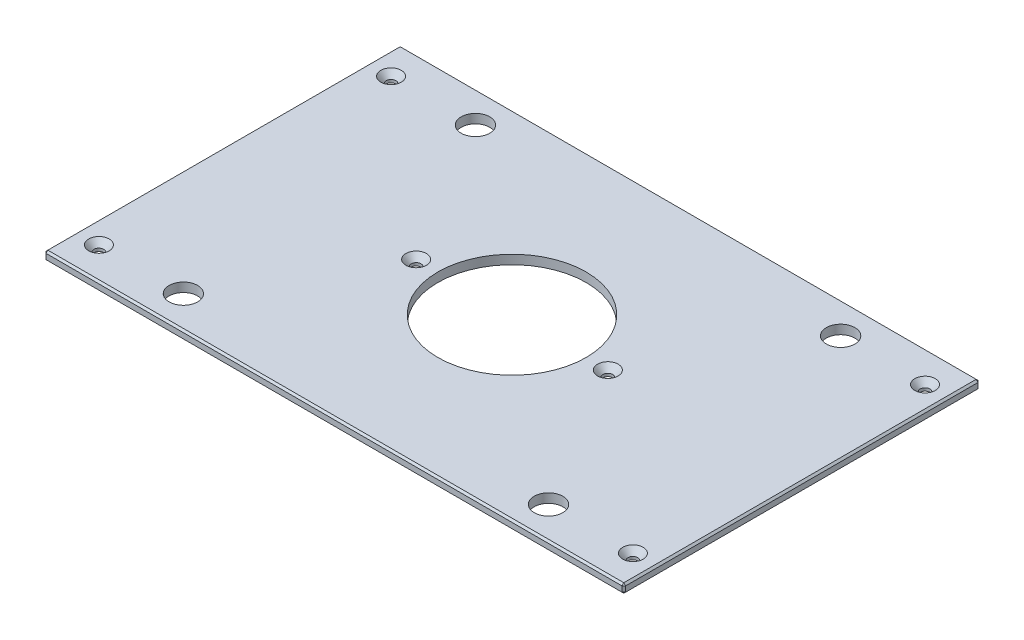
from build123d import *

# Parameters (mm, degrees)
SKETCH1_W                                     = 403.225
SKETCH1_H                                     = 247.65
BOSS_EXTRUDE1_DEPTH                           = 6.35
SKETCH13_R                                    = 51.562
CUT_EXTRUDE6_DEPTH                            = 237.686614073
F_25_32_0_78125_DIAMETER_HOLE1_D              = 19.84375
CHAMFER2_SIZE                                 = 1.27
CSK_FOR_1_4_FLAT_HEAD_MACHINE_SCREW1_AT_COUNT = 2
CSK_FOR_1_4_FLAT_HEAD_MACHINE_SCREW1_AT_PITCH = 203.2
CSK_FOR_1_4_FLAT_HEAD_MACHINE_SCREW1_2_COUNT  = 2
CSK_FOR_1_4_FLAT_HEAD_MACHINE_SCREW1_2_PITCH  = 423.419314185
CSK_FOR_1_4_FLAT_HEAD_MACHINE_SCREW1_3_COUNT  = 2
CSK_FOR_1_4_FLAT_HEAD_MACHINE_SCREW1_3_PITCH  = 272.093054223
CSK_FOR_1_4_FLAT_HEAD_MACHINE_SCREW1_4_COUNT  = 2
CSK_FOR_1_4_FLAT_HEAD_MACHINE_SCREW1_4_PITCH  = 156.519771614
CSK_FOR_1_4_FLAT_HEAD_MACHINE_SCREW1_5_COUNT  = 2
CSK_FOR_1_4_FLAT_HEAD_MACHINE_SCREW1_5_PITCH  = 371.475
CSK_FOR_1_4_FLAT_HEAD_MACHINE_SCREW1_6_COUNT  = 2
CSK_FOR_1_4_FLAT_HEAD_MACHINE_SCREW1_6_PITCH  = 312.7375
CSK_FOR_1_4_FLAT_HEAD_MACHINE_SCREW1_7_COUNT  = 2
CSK_FOR_1_4_FLAT_HEAD_MACHINE_SCREW1_7_PITCH  = 372.954399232


with BuildPart() as part:
    # Sketch1 → Boss-Extrude1 (new body)
    with BuildSketch(Plane(origin=(0, 0, 0), x_dir=(1, 0, 0), z_dir=(0, 1, 0))):
        Rectangle(SKETCH1_W, SKETCH1_H)
    extrude(amount=BOSS_EXTRUDE1_DEPTH)

    # Sketch13 → Cut-Extrude6 (cut, through all)
    with BuildSketch(Plane(origin=(0, 6.35, 0), x_dir=(1, 0, 0), z_dir=(0, 1, 0))):
        with Locations(Location((0, 0, 0), (0, 0, 270))):
            Circle(SKETCH13_R)
    extrude(amount=-CUT_EXTRUDE6_DEPTH, mode=Mode.SUBTRACT)

    # 25_32 _0.78125_ Diameter Hole1 (through all)
    with Locations(Plane(origin=(0, 6.35, 0), x_dir=(1, 0, 0), z_dir=(0, 1, 0))):
        with Locations((127, 101.6), (-127, 101.6), (127, -101.6), (-127, -101.6)):
            Hole(F_25_32_0_78125_DIAMETER_HOLE1_D / 2)

    # Chamfer2
    chamfer2_edges = [part.edges().sort_by_distance(p)[0] for p in [
        (201.6125, 6.35, 0),
        (0, 6.35, -123.825),
        (-201.6125, 6.35, 0),
        (0, 0, -123.825),
        (201.6125, 0, 0),
        (0, 0, 123.825),
        (-201.6125, 0, 0),
        (0, 6.35, 123.825),
        (-201.6125, 3.175, -123.825),
        (201.6125, 3.175, -123.825),
        (201.6125, 3.175, 123.825),
        (-201.6125, 3.175, 123.825),
    ]]
    chamfer(chamfer2_edges, length=CHAMFER2_SIZE)

    # Sketch24 → CSK for 1_4 Flat Head Machine Screw1 (revolve, cut)
    with BuildSketch(Plane(origin=(185.7375, 6.35, -101.6), x_dir=(0, 0, 1), z_dir=(1, 0, 0))):
        Polygon((0, 0), (0, 6.35), (3.3782, 6.35), (3.3782, 4.324464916), (7.1374, 0), align=None)
    csk_for_1_4_flat_head_machine_screw1 = revolve(axis=Axis((185.7375, 12.7, -101.6), (0, -1, 0)), mode=Mode.SUBTRACT)

    # CSK for 1_4 Flat Head Machine Screw1 at: CSK for 1_4 Flat Head Machine Screw1 ×2
    with Locations(*[(0, 0, i * CSK_FOR_1_4_FLAT_HEAD_MACHINE_SCREW1_AT_PITCH) for i in range(1, CSK_FOR_1_4_FLAT_HEAD_MACHINE_SCREW1_AT_COUNT)]):
        add(csk_for_1_4_flat_head_machine_screw1, mode=Mode.SUBTRACT)

    # CSK for 1_4 Flat Head Machine Screw1 2: CSK for 1_4 Flat Head Machine Screw1 ×2
    with Locations(*[Vector(-0.8773218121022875, 0, 0.4799025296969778) * (i * CSK_FOR_1_4_FLAT_HEAD_MACHINE_SCREW1_2_PITCH) for i in range(1, CSK_FOR_1_4_FLAT_HEAD_MACHINE_SCREW1_2_COUNT)]):
        add(csk_for_1_4_flat_head_machine_screw1, mode=Mode.SUBTRACT)

    # CSK for 1_4 Flat Head Machine Screw1 3: CSK for 1_4 Flat Head Machine Screw1 ×2
    with Locations(*[Vector(-0.9276697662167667, 0, 0.37340166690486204) * (i * CSK_FOR_1_4_FLAT_HEAD_MACHINE_SCREW1_3_PITCH) for i in range(1, CSK_FOR_1_4_FLAT_HEAD_MACHINE_SCREW1_3_COUNT)]):
        add(csk_for_1_4_flat_head_machine_screw1, mode=Mode.SUBTRACT)

    # CSK for 1_4 Flat Head Machine Screw1 4: CSK for 1_4 Flat Head Machine Screw1 ×2
    with Locations(*[Vector(-0.7606866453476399, 0, 0.6491192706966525) * (i * CSK_FOR_1_4_FLAT_HEAD_MACHINE_SCREW1_4_PITCH) for i in range(1, CSK_FOR_1_4_FLAT_HEAD_MACHINE_SCREW1_4_COUNT)]):
        add(csk_for_1_4_flat_head_machine_screw1, mode=Mode.SUBTRACT)

    # CSK for 1_4 Flat Head Machine Screw1 5: CSK for 1_4 Flat Head Machine Screw1 ×2
    with Locations(*[(-i * CSK_FOR_1_4_FLAT_HEAD_MACHINE_SCREW1_5_PITCH, 0, 0) for i in range(1, CSK_FOR_1_4_FLAT_HEAD_MACHINE_SCREW1_5_COUNT)]):
        add(csk_for_1_4_flat_head_machine_screw1, mode=Mode.SUBTRACT)

    # CSK for 1_4 Flat Head Machine Screw1 6: CSK for 1_4 Flat Head Machine Screw1 ×2
    with Locations(*[(-i * CSK_FOR_1_4_FLAT_HEAD_MACHINE_SCREW1_6_PITCH, 0, 0) for i in range(1, CSK_FOR_1_4_FLAT_HEAD_MACHINE_SCREW1_6_COUNT)]):
        add(csk_for_1_4_flat_head_machine_screw1, mode=Mode.SUBTRACT)

    # CSK for 1_4 Flat Head Machine Screw1 7: CSK for 1_4 Flat Head Machine Screw1 ×2
    with Locations(*[Vector(-0.8385408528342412, 0, 0.544838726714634) * (i * CSK_FOR_1_4_FLAT_HEAD_MACHINE_SCREW1_7_PITCH) for i in range(1, CSK_FOR_1_4_FLAT_HEAD_MACHINE_SCREW1_7_COUNT)]):
        add(csk_for_1_4_flat_head_machine_screw1, mode=Mode.SUBTRACT)


solid = part.part
